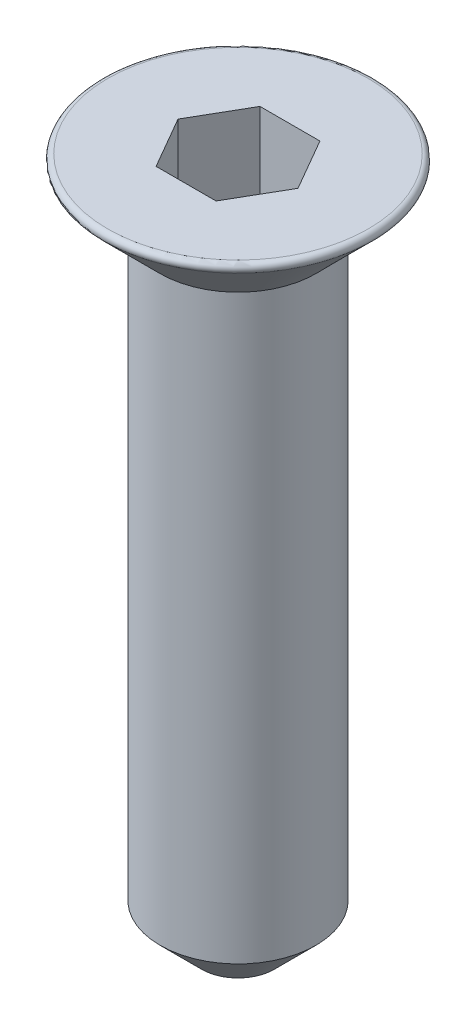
ISO-10303-21;
HEADER;
FILE_DESCRIPTION(('STEP AP214'),'2;1');
FILE_NAME('part.step','',(''),(''),'','','');
FILE_SCHEMA(('AUTOMOTIVE_DESIGN { 1 0 10303 214 1 1 1 1 }'));
ENDSEC;
DATA;
#1=APPLICATION_CONTEXT('core data for automotive mechanical design processes');
#2=APPLICATION_PROTOCOL_DEFINITION('international standard','automotive_design',2000,#1);
#3=PRODUCT_CONTEXT('',#1,'mechanical');
#4=PRODUCT('Part','Part','',(#3));
#5=PRODUCT_RELATED_PRODUCT_CATEGORY('part','',(#4));
#6=PRODUCT_DEFINITION_FORMATION('','',#4);
#7=PRODUCT_DEFINITION_CONTEXT('part definition',#1,'design');
#8=PRODUCT_DEFINITION('design','',#6,#7);
#9=PRODUCT_DEFINITION_SHAPE('','',#8);
#10=(LENGTH_UNIT() NAMED_UNIT(*) SI_UNIT(.MILLI.,.METRE.));
#11=(NAMED_UNIT(*) PLANE_ANGLE_UNIT() SI_UNIT($,.RADIAN.));
#12=(NAMED_UNIT(*) SI_UNIT($,.STERADIAN.) SOLID_ANGLE_UNIT());
#13=UNCERTAINTY_MEASURE_WITH_UNIT(LENGTH_MEASURE(1.E-05),#10,'distance_accuracy_value','');
#14=(GEOMETRIC_REPRESENTATION_CONTEXT(3) GLOBAL_UNCERTAINTY_ASSIGNED_CONTEXT((#13)) GLOBAL_UNIT_ASSIGNED_CONTEXT((#10,
#11,#12)) REPRESENTATION_CONTEXT('',''));
#15=CARTESIAN_POINT('',(0.,0.,0.));
#16=DIRECTION('',(0.,0.,1.));
#17=DIRECTION('',(1.,0.,0.));
#18=AXIS2_PLACEMENT_3D('',#15,#16,#17);
#19=CARTESIAN_POINT('',(0.,0.,0.));
#20=DIRECTION('',(0.,1.,0.));
#21=DIRECTION('',(0.,0.,1.));
#22=AXIS2_PLACEMENT_3D('',#19,#20,#21);
#23=PLANE('',#22);
#24=DIRECTION('',(0.5,0.,-0.866025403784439));
#25=VECTOR('',#24,1.);
#26=CARTESIAN_POINT('',(0.577350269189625,0.,1.));
#27=LINE('',#26,#25);
#28=CARTESIAN_POINT('',(0.577350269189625,0.,1.));
#29=VERTEX_POINT('',#28);
#30=CARTESIAN_POINT('',(1.15470053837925,0.,0.));
#31=VERTEX_POINT('',#30);
#32=EDGE_CURVE('E47',#29,#31,#27,.T.);
#33=ORIENTED_EDGE('',*,*,#32,.F.);
#34=DIRECTION('',(1.,0.,0.));
#35=VECTOR('',#34,1.);
#36=CARTESIAN_POINT('',(-0.577350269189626,0.,1.));
#37=LINE('',#36,#35);
#38=CARTESIAN_POINT('',(-0.577350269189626,0.,1.));
#39=VERTEX_POINT('',#38);
#40=EDGE_CURVE('E130',#39,#29,#37,.T.);
#41=ORIENTED_EDGE('',*,*,#40,.F.);
#42=DIRECTION('',(0.5,0.,0.866025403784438));
#43=VECTOR('',#42,1.);
#44=CARTESIAN_POINT('',(-1.15470053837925,0.,0.));
#45=LINE('',#44,#43);
#46=CARTESIAN_POINT('',(-1.15470053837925,0.,0.));
#47=VERTEX_POINT('',#46);
#48=EDGE_CURVE('E128',#47,#39,#45,.T.);
#49=ORIENTED_EDGE('',*,*,#48,.F.);
#50=DIRECTION('',(-0.5,0.,0.866025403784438));
#51=VECTOR('',#50,1.);
#52=CARTESIAN_POINT('',(-0.577350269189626,0.,-1.));
#53=LINE('',#52,#51);
#54=CARTESIAN_POINT('',(-0.577350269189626,0.,-1.));
#55=VERTEX_POINT('',#54);
#56=EDGE_CURVE('E95',#55,#47,#53,.T.);
#57=ORIENTED_EDGE('',*,*,#56,.F.);
#58=DIRECTION('',(-1.,0.,0.));
#59=VECTOR('',#58,1.);
#60=CARTESIAN_POINT('',(0.577350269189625,0.,-1.));
#61=LINE('',#60,#59);
#62=CARTESIAN_POINT('',(0.577350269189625,0.,-1.));
#63=VERTEX_POINT('',#62);
#64=EDGE_CURVE('E124',#63,#55,#61,.T.);
#65=ORIENTED_EDGE('',*,*,#64,.F.);
#66=DIRECTION('',(-0.5,0.,-0.866025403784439));
#67=VECTOR('',#66,1.);
#68=CARTESIAN_POINT('',(1.15470053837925,0.,0.));
#69=LINE('',#68,#67);
#70=EDGE_CURVE('E121',#31,#63,#69,.T.);
#71=ORIENTED_EDGE('',*,*,#70,.F.);
#72=EDGE_LOOP('',(#33,#41,#49,#57,#65,#71));
#73=FACE_BOUND('',#72,.T.);
#74=CARTESIAN_POINT('',(0.,0.,0.));
#75=DIRECTION('',(0.,1.,0.));
#76=DIRECTION('',(0.,0.,1.));
#77=AXIS2_PLACEMENT_3D('',#74,#75,#76);
#78=CIRCLE('',#77,2.50857864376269);
#79=CARTESIAN_POINT('',(0.,0.,2.50857864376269));
#80=VERTEX_POINT('',#79);
#81=EDGE_CURVE('E142',#80,#80,#78,.T.);
#82=ORIENTED_EDGE('',*,*,#81,.T.);
#83=EDGE_LOOP('',(#82));
#84=FACE_BOUND('',#83,.T.);
#85=ADVANCED_FACE('F32',(#73,#84),#23,.T.);
#86=CARTESIAN_POINT('',(0.,0.,0.));
#87=DIRECTION('',(0.,1.,0.));
#88=DIRECTION('',(0.,0.,1.));
#89=AXIS2_PLACEMENT_3D('',#86,#87,#88);
#90=CONICAL_SURFACE('',#89,2.75,0.78539816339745);
#91=CARTESIAN_POINT('',(0.,-0.170710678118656,0.));
#92=DIRECTION('',(0.,-1.,0.));
#93=DIRECTION('',(0.,0.,-1.));
#94=AXIS2_PLACEMENT_3D('',#91,#92,#93);
#95=CIRCLE('',#94,2.57928932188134);
#96=CARTESIAN_POINT('',(0.,-0.170710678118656,-2.57928932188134));
#97=VERTEX_POINT('',#96);
#98=EDGE_CURVE('E145',#97,#97,#95,.T.);
#99=ORIENTED_EDGE('',*,*,#98,.T.);
#100=EDGE_LOOP('',(#99));
#101=FACE_BOUND('',#100,.T.);
#102=CARTESIAN_POINT('',(0.,-1.25,0.));
#103=DIRECTION('',(0.,1.,0.));
#104=DIRECTION('',(0.,0.,1.));
#105=AXIS2_PLACEMENT_3D('',#102,#103,#104);
#106=CIRCLE('',#105,1.5);
#107=CARTESIAN_POINT('',(0.,-1.25,1.5));
#108=VERTEX_POINT('',#107);
#109=EDGE_CURVE('E134',#108,#108,#106,.T.);
#110=ORIENTED_EDGE('',*,*,#109,.T.);
#111=EDGE_LOOP('',(#110));
#112=FACE_BOUND('',#111,.T.);
#113=ADVANCED_FACE('F167',(#101,#112),#90,.T.);
#114=CARTESIAN_POINT('',(0.,15.4879719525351,0.));
#115=DIRECTION('',(0.,1.,0.));
#116=DIRECTION('',(0.,0.,1.));
#117=AXIS2_PLACEMENT_3D('',#114,#115,#116);
#118=CYLINDRICAL_SURFACE('',#117,1.5);
#119=CARTESIAN_POINT('',(0.,-12.45,0.));
#120=DIRECTION('',(0.,-1.,0.));
#121=DIRECTION('',(0.,0.,-1.));
#122=AXIS2_PLACEMENT_3D('',#119,#120,#121);
#123=CIRCLE('',#122,1.5);
#124=CARTESIAN_POINT('',(0.,-12.45,1.5));
#125=VERTEX_POINT('',#124);
#126=EDGE_CURVE('E40',#125,#125,#123,.F.);
#127=ORIENTED_EDGE('',*,*,#126,.T.);
#128=EDGE_LOOP('',(#127));
#129=FACE_BOUND('',#128,.T.);
#130=ORIENTED_EDGE('',*,*,#109,.F.);
#131=EDGE_LOOP('',(#130));
#132=FACE_BOUND('',#131,.T.);
#133=ADVANCED_FACE('F150',(#129,#132),#118,.T.);
#134=CARTESIAN_POINT('',(1.5,-13.25,0.));
#135=DIRECTION('',(0.,-1.,0.));
#136=DIRECTION('',(0.,0.,-1.));
#137=AXIS2_PLACEMENT_3D('',#134,#135,#136);
#138=PLANE('',#137);
#139=CARTESIAN_POINT('',(0.,-13.25,0.));
#140=DIRECTION('',(0.,-1.,0.));
#141=DIRECTION('',(0.,0.,-1.));
#142=AXIS2_PLACEMENT_3D('',#139,#140,#141);
#143=CIRCLE('',#142,0.699999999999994);
#144=CARTESIAN_POINT('',(0.,-13.25,0.699999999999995));
#145=VERTEX_POINT('',#144);
#146=EDGE_CURVE('E11',#145,#145,#143,.T.);
#147=ORIENTED_EDGE('',*,*,#146,.T.);
#148=EDGE_LOOP('',(#147));
#149=FACE_BOUND('',#148,.T.);
#150=ADVANCED_FACE('F163',(#149),#138,.T.);
#151=CARTESIAN_POINT('',(0.,-0.1,0.));
#152=DIRECTION('',(0.,1.,0.));
#153=DIRECTION('',(0.,0.,1.));
#154=AXIS2_PLACEMENT_3D('',#151,#152,#153);
#155=TOROIDAL_SURFACE('',#154,2.50857864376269,0.1);
#156=ORIENTED_EDGE('',*,*,#98,.F.);
#157=EDGE_LOOP('',(#156));
#158=FACE_BOUND('',#157,.T.);
#159=ORIENTED_EDGE('',*,*,#81,.F.);
#160=EDGE_LOOP('',(#159));
#161=FACE_BOUND('',#160,.T.);
#162=ADVANCED_FACE('F155',(#158,#161),#155,.T.);
#163=CARTESIAN_POINT('',(0.,-12.45,0.));
#164=DIRECTION('',(0.,1.,0.));
#165=DIRECTION('',(0.,0.,1.));
#166=AXIS2_PLACEMENT_3D('',#163,#164,#165);
#167=CONICAL_SURFACE('',#166,1.5,0.785398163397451);
#168=CARTESIAN_POINT('',(0.,-13.25,0.699999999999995));
#169=CARTESIAN_POINT('',(0.,-13.2416666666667,0.708333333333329));
#170=CARTESIAN_POINT('',(0.,-13.2333333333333,0.716666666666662));
#171=CARTESIAN_POINT('',(0.,-13.2166666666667,0.733333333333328));
#172=CARTESIAN_POINT('',(0.,-13.2083333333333,0.741666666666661));
#173=CARTESIAN_POINT('',(0.,-13.1916666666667,0.758333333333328));
#174=CARTESIAN_POINT('',(0.,-13.1833333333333,0.766666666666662));
#175=CARTESIAN_POINT('',(0.,-13.1666666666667,0.783333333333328));
#176=CARTESIAN_POINT('',(0.,-13.1583333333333,0.791666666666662));
#177=CARTESIAN_POINT('',(0.,-13.1416666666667,0.808333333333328));
#178=CARTESIAN_POINT('',(0.,-13.1333333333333,0.816666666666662));
#179=CARTESIAN_POINT('',(0.,-13.1166666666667,0.833333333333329));
#180=CARTESIAN_POINT('',(0.,-13.1083333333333,0.841666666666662));
#181=CARTESIAN_POINT('',(0.,-13.0916666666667,0.858333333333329));
#182=CARTESIAN_POINT('',(0.,-13.0833333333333,0.866666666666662));
#183=CARTESIAN_POINT('',(0.,-13.0666666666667,0.883333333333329));
#184=CARTESIAN_POINT('',(0.,-13.0583333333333,0.891666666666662));
#185=CARTESIAN_POINT('',(0.,-13.0416666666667,0.908333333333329));
#186=CARTESIAN_POINT('',(0.,-13.0333333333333,0.916666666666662));
#187=CARTESIAN_POINT('',(0.,-13.0166666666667,0.933333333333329));
#188=CARTESIAN_POINT('',(0.,-13.0083333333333,0.941666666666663));
#189=CARTESIAN_POINT('',(0.,-12.9916666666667,0.958333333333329));
#190=CARTESIAN_POINT('',(0.,-12.9833333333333,0.966666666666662));
#191=CARTESIAN_POINT('',(0.,-12.9666666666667,0.983333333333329));
#192=CARTESIAN_POINT('',(0.,-12.9583333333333,0.991666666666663));
#193=CARTESIAN_POINT('',(0.,-12.9416666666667,1.00833333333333));
#194=CARTESIAN_POINT('',(0.,-12.9333333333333,1.01666666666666));
#195=CARTESIAN_POINT('',(0.,-12.9166666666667,1.03333333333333));
#196=CARTESIAN_POINT('',(0.,-12.9083333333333,1.04166666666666));
#197=CARTESIAN_POINT('',(0.,-12.8916666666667,1.05833333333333));
#198=CARTESIAN_POINT('',(0.,-12.8833333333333,1.06666666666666));
#199=CARTESIAN_POINT('',(0.,-12.8666666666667,1.08333333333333));
#200=CARTESIAN_POINT('',(0.,-12.8583333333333,1.09166666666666));
#201=CARTESIAN_POINT('',(0.,-12.8416666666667,1.10833333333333));
#202=CARTESIAN_POINT('',(0.,-12.8333333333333,1.11666666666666));
#203=CARTESIAN_POINT('',(0.,-12.8166666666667,1.13333333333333));
#204=CARTESIAN_POINT('',(0.,-12.8083333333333,1.14166666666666));
#205=CARTESIAN_POINT('',(0.,-12.7916666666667,1.15833333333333));
#206=CARTESIAN_POINT('',(0.,-12.7833333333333,1.16666666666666));
#207=CARTESIAN_POINT('',(0.,-12.7666666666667,1.18333333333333));
#208=CARTESIAN_POINT('',(0.,-12.7583333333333,1.19166666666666));
#209=CARTESIAN_POINT('',(0.,-12.7416666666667,1.20833333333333));
#210=CARTESIAN_POINT('',(0.,-12.7333333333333,1.21666666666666));
#211=CARTESIAN_POINT('',(0.,-12.7166666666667,1.23333333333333));
#212=CARTESIAN_POINT('',(0.,-12.7083333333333,1.24166666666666));
#213=CARTESIAN_POINT('',(0.,-12.6916666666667,1.25833333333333));
#214=CARTESIAN_POINT('',(0.,-12.6833333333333,1.26666666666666));
#215=CARTESIAN_POINT('',(0.,-12.6666666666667,1.28333333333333));
#216=CARTESIAN_POINT('',(0.,-12.6583333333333,1.29166666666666));
#217=CARTESIAN_POINT('',(0.,-12.6416666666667,1.30833333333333));
#218=CARTESIAN_POINT('',(0.,-12.6333333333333,1.31666666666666));
#219=CARTESIAN_POINT('',(0.,-12.6166666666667,1.33333333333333));
#220=CARTESIAN_POINT('',(0.,-12.6083333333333,1.34166666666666));
#221=CARTESIAN_POINT('',(0.,-12.5916666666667,1.35833333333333));
#222=CARTESIAN_POINT('',(0.,-12.5833333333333,1.36666666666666));
#223=CARTESIAN_POINT('',(0.,-12.5666666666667,1.38333333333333));
#224=CARTESIAN_POINT('',(0.,-12.5583333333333,1.39166666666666));
#225=CARTESIAN_POINT('',(0.,-12.5416666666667,1.40833333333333));
#226=CARTESIAN_POINT('',(0.,-12.5333333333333,1.41666666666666));
#227=CARTESIAN_POINT('',(0.,-12.5166666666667,1.43333333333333));
#228=CARTESIAN_POINT('',(0.,-12.5083333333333,1.44166666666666));
#229=CARTESIAN_POINT('',(0.,-12.4916666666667,1.45833333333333));
#230=CARTESIAN_POINT('',(0.,-12.4833333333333,1.46666666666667));
#231=CARTESIAN_POINT('',(0.,-12.4666666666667,1.48333333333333));
#232=CARTESIAN_POINT('',(0.,-12.4583333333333,1.49166666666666));
#233=CARTESIAN_POINT('',(0.,-12.45,1.5));
#234=B_SPLINE_CURVE_WITH_KNOTS('',3,(#168,#169,#170,#171,#172,#173,#174,#175,#176,#177,#178,
#179,#180,#181,#182,#183,#184,#185,#186,#187,#188,#189,#190,#191,#192,#193,#194,#195,#196,#197,
#198,#199,#200,#201,#202,#203,#204,#205,#206,#207,#208,#209,#210,#211,#212,#213,#214,#215,#216,
#217,#218,#219,#220,#221,#222,#223,#224,#225,#226,#227,#228,#229,#230,#231,#232,#233),
.UNSPECIFIED.,.F.,.F.,(4,2,2,2,2,2,2,2,2,2,2,2,2,2,2,2,2,2,2,2,2,2,2,2,2,2,2,2,2,2,2,2,4),(0.,
0.0353553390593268,0.0707106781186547,0.106066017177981,0.141421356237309,0.176776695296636,
0.212132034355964,0.247487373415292,0.282842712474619,0.318198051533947,0.353553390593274,
0.388908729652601,0.424264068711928,0.459619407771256,0.494974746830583,0.530330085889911,
0.565685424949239,0.601040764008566,0.636396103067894,0.67175144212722,0.707106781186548,
0.742462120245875,0.777817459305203,0.81317279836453,0.848528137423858,0.883883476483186,
0.919238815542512,0.95459415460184,0.989949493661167,1.02530483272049,1.06066017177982,
1.09601551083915,1.13137084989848),.UNSPECIFIED.);
#235=EDGE_CURVE('BSEAM34',#145,#125,#234,.T.);
#236=ORIENTED_EDGE('',*,*,#146,.F.);
#237=ORIENTED_EDGE('',*,*,#126,.F.);
#238=ORIENTED_EDGE('',*,*,#235,.T.);
#239=ORIENTED_EDGE('',*,*,#235,.F.);
#240=EDGE_LOOP('',(#236,#238,#237,#239));
#241=FACE_BOUND('',#240,.T.);
#242=ADVANCED_FACE('F34',(#241),#167,.T.);
#243=CARTESIAN_POINT('',(0.577350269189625,-3.,1.));
#244=DIRECTION('',(0.866025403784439,0.,0.5));
#245=DIRECTION('',(0.5,0.,-0.866025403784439));
#246=AXIS2_PLACEMENT_3D('',#243,#244,#245);
#247=PLANE('',#246);
#248=ORIENTED_EDGE('',*,*,#32,.T.);
#249=DIRECTION('',(0.,1.,0.));
#250=VECTOR('',#249,1.);
#251=CARTESIAN_POINT('',(1.15470053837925,-3.,0.));
#252=LINE('',#251,#250);
#253=CARTESIAN_POINT('',(1.15470053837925,-3.,0.));
#254=VERTEX_POINT('',#253);
#255=EDGE_CURVE('E77',#254,#31,#252,.T.);
#256=ORIENTED_EDGE('',*,*,#255,.F.);
#257=DIRECTION('',(0.5,0.,-0.866025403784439));
#258=VECTOR('',#257,1.);
#259=CARTESIAN_POINT('',(0.577350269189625,-3.,1.));
#260=LINE('',#259,#258);
#261=CARTESIAN_POINT('',(0.577350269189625,-3.,1.));
#262=VERTEX_POINT('',#261);
#263=EDGE_CURVE('E132',#262,#254,#260,.T.);
#264=ORIENTED_EDGE('',*,*,#263,.F.);
#265=DIRECTION('',(0.,1.,0.));
#266=VECTOR('',#265,1.);
#267=CARTESIAN_POINT('',(0.577350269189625,-3.,1.));
#268=LINE('',#267,#266);
#269=EDGE_CURVE('E55',#262,#29,#268,.T.);
#270=ORIENTED_EDGE('',*,*,#269,.T.);
#271=EDGE_LOOP('',(#248,#256,#264,#270));
#272=FACE_BOUND('',#271,.T.);
#273=ADVANCED_FACE('F154',(#272),#247,.F.);
#274=CARTESIAN_POINT('',(-0.577350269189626,-3.,1.));
#275=DIRECTION('',(0.,0.,1.));
#276=DIRECTION('',(1.,0.,0.));
#277=AXIS2_PLACEMENT_3D('',#274,#275,#276);
#278=PLANE('',#277);
#279=ORIENTED_EDGE('',*,*,#40,.T.);
#280=ORIENTED_EDGE('',*,*,#269,.F.);
#281=DIRECTION('',(1.,0.,0.));
#282=VECTOR('',#281,1.);
#283=CARTESIAN_POINT('',(-0.577350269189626,-3.,1.));
#284=LINE('',#283,#282);
#285=CARTESIAN_POINT('',(-0.577350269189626,-3.,1.));
#286=VERTEX_POINT('',#285);
#287=EDGE_CURVE('E107',#286,#262,#284,.T.);
#288=ORIENTED_EDGE('',*,*,#287,.F.);
#289=DIRECTION('',(0.,1.,0.));
#290=VECTOR('',#289,1.);
#291=CARTESIAN_POINT('',(-0.577350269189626,-3.,1.));
#292=LINE('',#291,#290);
#293=EDGE_CURVE('E99',#286,#39,#292,.T.);
#294=ORIENTED_EDGE('',*,*,#293,.T.);
#295=EDGE_LOOP('',(#279,#280,#288,#294));
#296=FACE_BOUND('',#295,.T.);
#297=ADVANCED_FACE('F161',(#296),#278,.F.);
#298=CARTESIAN_POINT('',(-1.15470053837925,-3.,0.));
#299=DIRECTION('',(-0.866025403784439,0.,0.5));
#300=DIRECTION('',(0.5,0.,0.866025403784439));
#301=AXIS2_PLACEMENT_3D('',#298,#299,#300);
#302=PLANE('',#301);
#303=ORIENTED_EDGE('',*,*,#48,.T.);
#304=ORIENTED_EDGE('',*,*,#293,.F.);
#305=DIRECTION('',(0.5,0.,0.866025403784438));
#306=VECTOR('',#305,1.);
#307=CARTESIAN_POINT('',(-1.15470053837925,-3.,0.));
#308=LINE('',#307,#306);
#309=CARTESIAN_POINT('',(-1.15470053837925,-3.,0.));
#310=VERTEX_POINT('',#309);
#311=EDGE_CURVE('E103',#310,#286,#308,.T.);
#312=ORIENTED_EDGE('',*,*,#311,.F.);
#313=DIRECTION('',(0.,1.,0.));
#314=VECTOR('',#313,1.);
#315=CARTESIAN_POINT('',(-1.15470053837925,-3.,0.));
#316=LINE('',#315,#314);
#317=EDGE_CURVE('E88',#310,#47,#316,.T.);
#318=ORIENTED_EDGE('',*,*,#317,.T.);
#319=EDGE_LOOP('',(#303,#304,#312,#318));
#320=FACE_BOUND('',#319,.T.);
#321=ADVANCED_FACE('F104',(#320),#302,.F.);
#322=CARTESIAN_POINT('',(-0.577350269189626,-3.,-1.));
#323=DIRECTION('',(-0.866025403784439,0.,-0.5));
#324=DIRECTION('',(-0.5,0.,0.866025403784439));
#325=AXIS2_PLACEMENT_3D('',#322,#323,#324);
#326=PLANE('',#325);
#327=ORIENTED_EDGE('',*,*,#56,.T.);
#328=ORIENTED_EDGE('',*,*,#317,.F.);
#329=DIRECTION('',(-0.5,0.,0.866025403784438));
#330=VECTOR('',#329,1.);
#331=CARTESIAN_POINT('',(-0.577350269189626,-3.,-1.));
#332=LINE('',#331,#330);
#333=CARTESIAN_POINT('',(-0.577350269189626,-3.,-1.));
#334=VERTEX_POINT('',#333);
#335=EDGE_CURVE('E92',#334,#310,#332,.T.);
#336=ORIENTED_EDGE('',*,*,#335,.F.);
#337=DIRECTION('',(0.,1.,0.));
#338=VECTOR('',#337,1.);
#339=CARTESIAN_POINT('',(-0.577350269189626,-3.,-1.));
#340=LINE('',#339,#338);
#341=EDGE_CURVE('E100',#334,#55,#340,.T.);
#342=ORIENTED_EDGE('',*,*,#341,.T.);
#343=EDGE_LOOP('',(#327,#328,#336,#342));
#344=FACE_BOUND('',#343,.T.);
#345=ADVANCED_FACE('F90',(#344),#326,.F.);
#346=CARTESIAN_POINT('',(0.577350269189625,-3.,-1.));
#347=DIRECTION('',(0.,0.,-1.));
#348=DIRECTION('',(-1.,0.,0.));
#349=AXIS2_PLACEMENT_3D('',#346,#347,#348);
#350=PLANE('',#349);
#351=ORIENTED_EDGE('',*,*,#64,.T.);
#352=ORIENTED_EDGE('',*,*,#341,.F.);
#353=DIRECTION('',(-1.,0.,0.));
#354=VECTOR('',#353,1.);
#355=CARTESIAN_POINT('',(0.577350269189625,-3.,-1.));
#356=LINE('',#355,#354);
#357=CARTESIAN_POINT('',(0.577350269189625,-3.,-1.));
#358=VERTEX_POINT('',#357);
#359=EDGE_CURVE('E113',#358,#334,#356,.T.);
#360=ORIENTED_EDGE('',*,*,#359,.F.);
#361=DIRECTION('',(0.,1.,0.));
#362=VECTOR('',#361,1.);
#363=CARTESIAN_POINT('',(0.577350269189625,-3.,-1.));
#364=LINE('',#363,#362);
#365=EDGE_CURVE('E137',#358,#63,#364,.T.);
#366=ORIENTED_EDGE('',*,*,#365,.T.);
#367=EDGE_LOOP('',(#351,#352,#360,#366));
#368=FACE_BOUND('',#367,.T.);
#369=ADVANCED_FACE('F185',(#368),#350,.F.);
#370=CARTESIAN_POINT('',(1.15470053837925,-3.,0.));
#371=DIRECTION('',(0.866025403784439,0.,-0.5));
#372=DIRECTION('',(-0.5,0.,-0.866025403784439));
#373=AXIS2_PLACEMENT_3D('',#370,#371,#372);
#374=PLANE('',#373);
#375=ORIENTED_EDGE('',*,*,#70,.T.);
#376=ORIENTED_EDGE('',*,*,#365,.F.);
#377=DIRECTION('',(-0.5,0.,-0.866025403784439));
#378=VECTOR('',#377,1.);
#379=CARTESIAN_POINT('',(1.15470053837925,-3.,0.));
#380=LINE('',#379,#378);
#381=EDGE_CURVE('E115',#254,#358,#380,.T.);
#382=ORIENTED_EDGE('',*,*,#381,.F.);
#383=ORIENTED_EDGE('',*,*,#255,.T.);
#384=EDGE_LOOP('',(#375,#376,#382,#383));
#385=FACE_BOUND('',#384,.T.);
#386=ADVANCED_FACE('F182',(#385),#374,.F.);
#387=CARTESIAN_POINT('',(1.15470053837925,-3.,0.));
#388=DIRECTION('',(0.,1.,0.));
#389=DIRECTION('',(0.,0.,1.));
#390=AXIS2_PLACEMENT_3D('',#387,#388,#389);
#391=PLANE('',#390);
#392=ORIENTED_EDGE('',*,*,#263,.T.);
#393=ORIENTED_EDGE('',*,*,#381,.T.);
#394=ORIENTED_EDGE('',*,*,#359,.T.);
#395=ORIENTED_EDGE('',*,*,#335,.T.);
#396=ORIENTED_EDGE('',*,*,#311,.T.);
#397=ORIENTED_EDGE('',*,*,#287,.T.);
#398=EDGE_LOOP('',(#392,#393,#394,#395,#396,#397));
#399=FACE_BOUND('',#398,.T.);
#400=ADVANCED_FACE('F110',(#399),#391,.T.);
#401=CLOSED_SHELL('',(#85,#113,#133,#150,#162,#242,#273,#297,#321,#345,#369,#386,#400));
#402=MANIFOLD_SOLID_BREP('B2',#401);
#403=ADVANCED_BREP_SHAPE_REPRESENTATION('',(#18,#402),#14);
#404=SHAPE_DEFINITION_REPRESENTATION(#9,#403);
ENDSEC;
END-ISO-10303-21;
